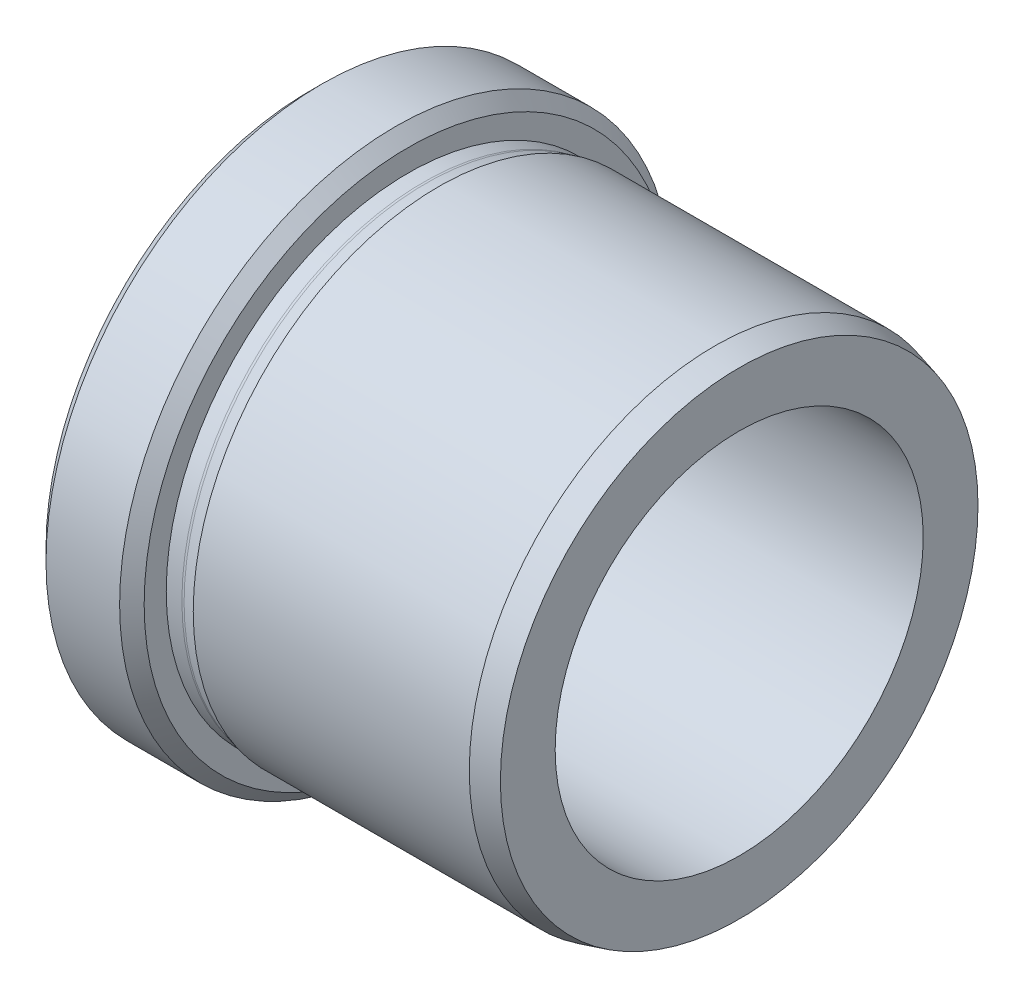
ISO-10303-21;
HEADER;
FILE_DESCRIPTION(('STEP AP214'),'2;1');
FILE_NAME('part.step','',(''),(''),'','','');
FILE_SCHEMA(('AUTOMOTIVE_DESIGN { 1 0 10303 214 1 1 1 1 }'));
ENDSEC;
DATA;
#1=APPLICATION_CONTEXT('core data for automotive mechanical design processes');
#2=APPLICATION_PROTOCOL_DEFINITION('international standard','automotive_design',2000,#1);
#3=PRODUCT_CONTEXT('',#1,'mechanical');
#4=PRODUCT('Part','Part','',(#3));
#5=PRODUCT_RELATED_PRODUCT_CATEGORY('part','',(#4));
#6=PRODUCT_DEFINITION_FORMATION('','',#4);
#7=PRODUCT_DEFINITION_CONTEXT('part definition',#1,'design');
#8=PRODUCT_DEFINITION('design','',#6,#7);
#9=PRODUCT_DEFINITION_SHAPE('','',#8);
#10=(LENGTH_UNIT() NAMED_UNIT(*) SI_UNIT(.MILLI.,.METRE.));
#11=(NAMED_UNIT(*) PLANE_ANGLE_UNIT() SI_UNIT($,.RADIAN.));
#12=(NAMED_UNIT(*) SI_UNIT($,.STERADIAN.) SOLID_ANGLE_UNIT());
#13=UNCERTAINTY_MEASURE_WITH_UNIT(LENGTH_MEASURE(1.E-05),#10,'distance_accuracy_value','');
#14=(GEOMETRIC_REPRESENTATION_CONTEXT(3) GLOBAL_UNCERTAINTY_ASSIGNED_CONTEXT((#13)) GLOBAL_UNIT_ASSIGNED_CONTEXT((#10,
#11,#12)) REPRESENTATION_CONTEXT('',''));
#15=CARTESIAN_POINT('',(0.,0.,0.));
#16=DIRECTION('',(0.,0.,1.));
#17=DIRECTION('',(1.,0.,0.));
#18=AXIS2_PLACEMENT_3D('',#15,#16,#17);
#19=CARTESIAN_POINT('',(20.075539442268,0.,0.));
#20=DIRECTION('',(-1.,0.,0.));
#21=DIRECTION('',(0.,0.,1.));
#22=AXIS2_PLACEMENT_3D('',#19,#20,#21);
#23=TOROIDAL_SURFACE('',#22,20.5,0.8);
#24=CARTESIAN_POINT('',(20.075539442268,0.,0.));
#25=DIRECTION('',(-1.,0.,0.));
#26=DIRECTION('',(0.,0.,1.));
#27=AXIS2_PLACEMENT_3D('',#24,#25,#26);
#28=CIRCLE('',#27,19.7);
#29=CARTESIAN_POINT('',(20.075539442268,0.,19.7));
#30=VERTEX_POINT('',#29);
#31=EDGE_CURVE('E58',#30,#30,#28,.T.);
#32=ORIENTED_EDGE('',*,*,#31,.F.);
#33=EDGE_LOOP('',(#32));
#34=FACE_BOUND('',#33,.T.);
#35=CARTESIAN_POINT('',(20.28259467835,0.,0.));
#36=DIRECTION('',(-1.,0.,0.));
#37=DIRECTION('',(0.,0.,1.));
#38=AXIS2_PLACEMENT_3D('',#35,#36,#37);
#39=CIRCLE('',#38,19.7272593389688);
#40=CARTESIAN_POINT('',(20.28259467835,0.,19.7272593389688));
#41=VERTEX_POINT('',#40);
#42=EDGE_CURVE('E40',#41,#41,#39,.T.);
#43=ORIENTED_EDGE('',*,*,#42,.T.);
#44=EDGE_LOOP('',(#43));
#45=FACE_BOUND('',#44,.T.);
#46=ADVANCED_FACE('F14',(#34,#45),#23,.F.);
#47=CARTESIAN_POINT('',(21.3004766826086,0.,0.));
#48=DIRECTION('',(1.,0.,0.));
#49=DIRECTION('',(0.,0.,-1.));
#50=AXIS2_PLACEMENT_3D('',#47,#48,#49);
#51=CONICAL_SURFACE('',#50,20.,0.261799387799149);
#52=ORIENTED_EDGE('',*,*,#42,.F.);
#53=EDGE_LOOP('',(#52));
#54=FACE_BOUND('',#53,.T.);
#55=CARTESIAN_POINT('',(21.3004766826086,0.,0.));
#56=DIRECTION('',(-1.,0.,0.));
#57=DIRECTION('',(0.,0.,1.));
#58=AXIS2_PLACEMENT_3D('',#55,#56,#57);
#59=CIRCLE('',#58,20.);
#60=CARTESIAN_POINT('',(21.3004766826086,0.,20.));
#61=VERTEX_POINT('',#60);
#62=EDGE_CURVE('E43',#61,#61,#59,.T.);
#63=ORIENTED_EDGE('',*,*,#62,.T.);
#64=EDGE_LOOP('',(#63));
#65=FACE_BOUND('',#64,.T.);
#66=ADVANCED_FACE('F66',(#54,#65),#51,.T.);
#67=CARTESIAN_POINT('',(0.,0.,0.));
#68=DIRECTION('',(-1.,0.,0.));
#69=DIRECTION('',(0.,0.,1.));
#70=AXIS2_PLACEMENT_3D('',#67,#68,#69);
#71=CYLINDRICAL_SURFACE('',#70,20.);
#72=ORIENTED_EDGE('',*,*,#62,.F.);
#73=EDGE_LOOP('',(#72));
#74=FACE_BOUND('',#73,.T.);
#75=CARTESIAN_POINT('',(43.8004766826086,0.,0.));
#76=DIRECTION('',(-1.,0.,0.));
#77=DIRECTION('',(0.,0.,1.));
#78=AXIS2_PLACEMENT_3D('',#75,#76,#77);
#79=CIRCLE('',#78,20.);
#80=CARTESIAN_POINT('',(43.8004766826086,0.,20.));
#81=VERTEX_POINT('',#80);
#82=EDGE_CURVE('E46',#81,#81,#79,.T.);
#83=ORIENTED_EDGE('',*,*,#82,.T.);
#84=EDGE_LOOP('',(#83));
#85=FACE_BOUND('',#84,.T.);
#86=ADVANCED_FACE('F72',(#74,#85),#71,.T.);
#87=CARTESIAN_POINT('',(45.8004766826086,0.,0.));
#88=DIRECTION('',(-1.,0.,0.));
#89=DIRECTION('',(0.,0.,1.));
#90=AXIS2_PLACEMENT_3D('',#87,#88,#89);
#91=CONICAL_SURFACE('',#90,19.4641016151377,0.26179938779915);
#92=ORIENTED_EDGE('',*,*,#82,.F.);
#93=EDGE_LOOP('',(#92));
#94=FACE_BOUND('',#93,.T.);
#95=CARTESIAN_POINT('',(45.8004766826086,0.,0.));
#96=DIRECTION('',(-1.,0.,0.));
#97=DIRECTION('',(0.,0.,1.));
#98=AXIS2_PLACEMENT_3D('',#95,#96,#97);
#99=CIRCLE('',#98,19.4641016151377);
#100=CARTESIAN_POINT('',(45.8004766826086,0.,19.4641016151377));
#101=VERTEX_POINT('',#100);
#102=EDGE_CURVE('E49',#101,#101,#99,.T.);
#103=ORIENTED_EDGE('',*,*,#102,.T.);
#104=EDGE_LOOP('',(#103));
#105=FACE_BOUND('',#104,.T.);
#106=ADVANCED_FACE('F78',(#94,#105),#91,.T.);
#107=CARTESIAN_POINT('',(45.8004766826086,19.4641016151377,0.));
#108=DIRECTION('',(-1.,0.,0.));
#109=DIRECTION('',(0.,0.,1.));
#110=AXIS2_PLACEMENT_3D('',#107,#108,#109);
#111=PLANE('',#110);
#112=ORIENTED_EDGE('',*,*,#102,.F.);
#113=EDGE_LOOP('',(#112));
#114=FACE_BOUND('',#113,.T.);
#115=CARTESIAN_POINT('',(45.8004766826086,0.,0.));
#116=DIRECTION('',(-1.,0.,0.));
#117=DIRECTION('',(0.,0.,1.));
#118=AXIS2_PLACEMENT_3D('',#115,#116,#117);
#119=CIRCLE('',#118,15.);
#120=CARTESIAN_POINT('',(45.8004766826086,0.,15.));
#121=VERTEX_POINT('',#120);
#122=EDGE_CURVE('E52',#121,#121,#119,.T.);
#123=ORIENTED_EDGE('',*,*,#122,.T.);
#124=EDGE_LOOP('',(#123));
#125=FACE_BOUND('',#124,.T.);
#126=ADVANCED_FACE('F84',(#114,#125),#111,.F.);
#127=CARTESIAN_POINT('',(0.,0.,0.));
#128=DIRECTION('',(-1.,0.,0.));
#129=DIRECTION('',(0.,0.,1.));
#130=AXIS2_PLACEMENT_3D('',#127,#128,#129);
#131=CYLINDRICAL_SURFACE('',#130,15.);
#132=CARTESIAN_POINT('',(12.3004766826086,0.,0.));
#133=DIRECTION('',(1.,0.,0.));
#134=DIRECTION('',(0.,0.,-1.));
#135=AXIS2_PLACEMENT_3D('',#132,#133,#134);
#136=CIRCLE('',#135,15.);
#137=CARTESIAN_POINT('',(12.3004766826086,0.,-15.));
#138=VERTEX_POINT('',#137);
#139=EDGE_CURVE('E29',#138,#138,#136,.F.);
#140=ORIENTED_EDGE('',*,*,#139,.T.);
#141=EDGE_LOOP('',(#140));
#142=FACE_BOUND('',#141,.T.);
#143=ORIENTED_EDGE('',*,*,#122,.F.);
#144=EDGE_LOOP('',(#143));
#145=FACE_BOUND('',#144,.T.);
#146=ADVANCED_FACE('F90',(#142,#145),#131,.F.);
#147=CARTESIAN_POINT('',(10.8004766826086,22.5,0.));
#148=DIRECTION('',(1.,0.,0.));
#149=DIRECTION('',(0.,0.,-1.));
#150=AXIS2_PLACEMENT_3D('',#147,#148,#149);
#151=PLANE('',#150);
#152=CARTESIAN_POINT('',(10.8004766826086,0.,0.));
#153=DIRECTION('',(1.,0.,0.));
#154=DIRECTION('',(0.,0.,-1.));
#155=AXIS2_PLACEMENT_3D('',#152,#153,#154);
#156=CIRCLE('',#155,16.5);
#157=CARTESIAN_POINT('',(10.8004766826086,0.,-16.5));
#158=VERTEX_POINT('',#157);
#159=EDGE_CURVE('E25',#158,#158,#156,.T.);
#160=ORIENTED_EDGE('',*,*,#159,.T.);
#161=EDGE_LOOP('',(#160));
#162=FACE_BOUND('',#161,.T.);
#163=CARTESIAN_POINT('',(10.8004766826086,0.,0.));
#164=DIRECTION('',(1.,0.,0.));
#165=DIRECTION('',(0.,0.,-1.));
#166=AXIS2_PLACEMENT_3D('',#163,#164,#165);
#167=CIRCLE('',#166,21.5);
#168=CARTESIAN_POINT('',(10.8004766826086,0.,-21.5));
#169=VERTEX_POINT('',#168);
#170=EDGE_CURVE('E37',#169,#169,#167,.F.);
#171=ORIENTED_EDGE('',*,*,#170,.T.);
#172=EDGE_LOOP('',(#171));
#173=FACE_BOUND('',#172,.T.);
#174=ADVANCED_FACE('F95',(#162,#173),#151,.F.);
#175=CARTESIAN_POINT('',(0.,0.,0.));
#176=DIRECTION('',(-1.,0.,0.));
#177=DIRECTION('',(0.,0.,1.));
#178=AXIS2_PLACEMENT_3D('',#175,#176,#177);
#179=CYLINDRICAL_SURFACE('',#178,22.5);
#180=CARTESIAN_POINT('',(17.8004766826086,0.,0.));
#181=DIRECTION('',(-1.,0.,0.));
#182=DIRECTION('',(0.,0.,1.));
#183=AXIS2_PLACEMENT_3D('',#180,#181,#182);
#184=CIRCLE('',#183,22.5);
#185=CARTESIAN_POINT('',(17.8004766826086,0.,22.5));
#186=VERTEX_POINT('',#185);
#187=EDGE_CURVE('E21',#186,#186,#184,.T.);
#188=ORIENTED_EDGE('',*,*,#187,.T.);
#189=EDGE_LOOP('',(#188));
#190=FACE_BOUND('',#189,.T.);
#191=CARTESIAN_POINT('',(11.8004766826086,0.,0.));
#192=DIRECTION('',(1.,0.,0.));
#193=DIRECTION('',(0.,0.,-1.));
#194=AXIS2_PLACEMENT_3D('',#191,#192,#193);
#195=CIRCLE('',#194,22.5);
#196=CARTESIAN_POINT('',(11.8004766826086,0.,-22.5));
#197=VERTEX_POINT('',#196);
#198=EDGE_CURVE('E34',#197,#197,#195,.T.);
#199=ORIENTED_EDGE('',*,*,#198,.T.);
#200=EDGE_LOOP('',(#199));
#201=FACE_BOUND('',#200,.T.);
#202=ADVANCED_FACE('F103',(#190,#201),#179,.T.);
#203=CARTESIAN_POINT('',(18.8004766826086,22.5,0.));
#204=DIRECTION('',(-1.,0.,0.));
#205=DIRECTION('',(0.,0.,1.));
#206=AXIS2_PLACEMENT_3D('',#203,#204,#205);
#207=PLANE('',#206);
#208=CARTESIAN_POINT('',(18.8004766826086,0.,0.));
#209=DIRECTION('',(-1.,0.,0.));
#210=DIRECTION('',(0.,0.,1.));
#211=AXIS2_PLACEMENT_3D('',#208,#209,#210);
#212=CIRCLE('',#211,21.5);
#213=CARTESIAN_POINT('',(18.8004766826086,0.,21.5));
#214=VERTEX_POINT('',#213);
#215=EDGE_CURVE('E9',#214,#214,#212,.F.);
#216=ORIENTED_EDGE('',*,*,#215,.T.);
#217=EDGE_LOOP('',(#216));
#218=FACE_BOUND('',#217,.T.);
#219=CARTESIAN_POINT('',(18.8004766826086,0.,0.));
#220=DIRECTION('',(-1.,0.,0.));
#221=DIRECTION('',(0.,0.,1.));
#222=AXIS2_PLACEMENT_3D('',#219,#220,#221);
#223=CIRCLE('',#222,19.7);
#224=CARTESIAN_POINT('',(18.8004766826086,0.,19.7));
#225=VERTEX_POINT('',#224);
#226=EDGE_CURVE('E55',#225,#225,#223,.T.);
#227=ORIENTED_EDGE('',*,*,#226,.T.);
#228=EDGE_LOOP('',(#227));
#229=FACE_BOUND('',#228,.T.);
#230=ADVANCED_FACE('F142',(#218,#229),#207,.F.);
#231=CARTESIAN_POINT('',(0.,0.,0.));
#232=DIRECTION('',(-1.,0.,0.));
#233=DIRECTION('',(0.,0.,1.));
#234=AXIS2_PLACEMENT_3D('',#231,#232,#233);
#235=CYLINDRICAL_SURFACE('',#234,19.7);
#236=ORIENTED_EDGE('',*,*,#226,.F.);
#237=EDGE_LOOP('',(#236));
#238=FACE_BOUND('',#237,.T.);
#239=ORIENTED_EDGE('',*,*,#31,.T.);
#240=EDGE_LOOP('',(#239));
#241=FACE_BOUND('',#240,.T.);
#242=ADVANCED_FACE('F62',(#238,#241),#235,.T.);
#243=CARTESIAN_POINT('',(10.8004766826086,0.,0.));
#244=DIRECTION('',(1.,0.,0.));
#245=DIRECTION('',(0.,0.,-1.));
#246=AXIS2_PLACEMENT_3D('',#243,#244,#245);
#247=CONICAL_SURFACE('',#246,21.5,0.785398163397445);
#248=ORIENTED_EDGE('',*,*,#198,.F.);
#249=EDGE_LOOP('',(#248));
#250=FACE_BOUND('',#249,.T.);
#251=ORIENTED_EDGE('',*,*,#170,.F.);
#252=EDGE_LOOP('',(#251));
#253=FACE_BOUND('',#252,.T.);
#254=ADVANCED_FACE('F108',(#250,#253),#247,.T.);
#255=CARTESIAN_POINT('',(12.3004766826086,0.,0.));
#256=DIRECTION('',(1.,0.,0.));
#257=DIRECTION('',(0.,0.,-1.));
#258=AXIS2_PLACEMENT_3D('',#255,#256,#257);
#259=TOROIDAL_SURFACE('',#258,16.5,1.5);
#260=ORIENTED_EDGE('',*,*,#159,.F.);
#261=EDGE_LOOP('',(#260));
#262=FACE_BOUND('',#261,.T.);
#263=ORIENTED_EDGE('',*,*,#139,.F.);
#264=EDGE_LOOP('',(#263));
#265=FACE_BOUND('',#264,.T.);
#266=ADVANCED_FACE('F110',(#262,#265),#259,.T.);
#267=CARTESIAN_POINT('',(17.8004766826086,0.,0.));
#268=DIRECTION('',(-1.,0.,0.));
#269=DIRECTION('',(0.,0.,1.));
#270=AXIS2_PLACEMENT_3D('',#267,#268,#269);
#271=CONICAL_SURFACE('',#270,22.5,0.78539816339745);
#272=ORIENTED_EDGE('',*,*,#215,.F.);
#273=EDGE_LOOP('',(#272));
#274=FACE_BOUND('',#273,.T.);
#275=ORIENTED_EDGE('',*,*,#187,.F.);
#276=EDGE_LOOP('',(#275));
#277=FACE_BOUND('',#276,.T.);
#278=ADVANCED_FACE('F16',(#274,#277),#271,.T.);
#279=CLOSED_SHELL('',(#46,#66,#86,#106,#126,#146,#174,#202,#230,#242,#254,#266,#278));
#280=MANIFOLD_SOLID_BREP('B1',#279);
#281=ADVANCED_BREP_SHAPE_REPRESENTATION('',(#18,#280),#14);
#282=SHAPE_DEFINITION_REPRESENTATION(#9,#281);
ENDSEC;
END-ISO-10303-21;
